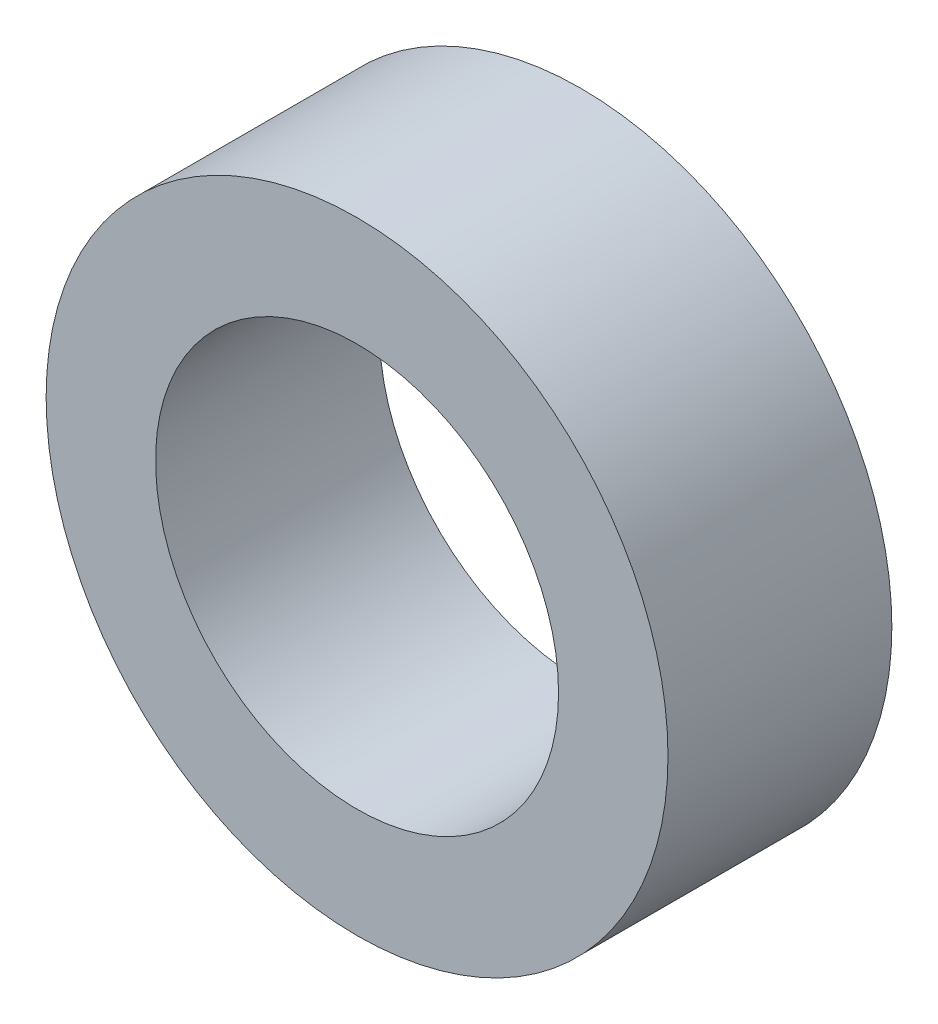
ISO-10303-21;
HEADER;
FILE_DESCRIPTION(('STEP AP214'),'2;1');
FILE_NAME('part.step','',(''),(''),'','','');
FILE_SCHEMA(('AUTOMOTIVE_DESIGN { 1 0 10303 214 1 1 1 1 }'));
ENDSEC;
DATA;
#1=APPLICATION_CONTEXT('core data for automotive mechanical design processes');
#2=APPLICATION_PROTOCOL_DEFINITION('international standard','automotive_design',2000,#1);
#3=PRODUCT_CONTEXT('',#1,'mechanical');
#4=PRODUCT('Part','Part','',(#3));
#5=PRODUCT_RELATED_PRODUCT_CATEGORY('part','',(#4));
#6=PRODUCT_DEFINITION_FORMATION('','',#4);
#7=PRODUCT_DEFINITION_CONTEXT('part definition',#1,'design');
#8=PRODUCT_DEFINITION('design','',#6,#7);
#9=PRODUCT_DEFINITION_SHAPE('','',#8);
#10=(LENGTH_UNIT() NAMED_UNIT(*) SI_UNIT(.MILLI.,.METRE.));
#11=(NAMED_UNIT(*) PLANE_ANGLE_UNIT() SI_UNIT($,.RADIAN.));
#12=(NAMED_UNIT(*) SI_UNIT($,.STERADIAN.) SOLID_ANGLE_UNIT());
#13=UNCERTAINTY_MEASURE_WITH_UNIT(LENGTH_MEASURE(1.E-05),#10,'distance_accuracy_value','');
#14=(GEOMETRIC_REPRESENTATION_CONTEXT(3) GLOBAL_UNCERTAINTY_ASSIGNED_CONTEXT((#13)) GLOBAL_UNIT_ASSIGNED_CONTEXT((#10,
#11,#12)) REPRESENTATION_CONTEXT('',''));
#15=CARTESIAN_POINT('',(0.,0.,0.));
#16=DIRECTION('',(0.,0.,1.));
#17=DIRECTION('',(1.,0.,0.));
#18=AXIS2_PLACEMENT_3D('',#15,#16,#17);
#19=CARTESIAN_POINT('',(0.,0.,9.));
#20=DIRECTION('',(0.,0.,1.));
#21=DIRECTION('',(1.,0.,0.));
#22=AXIS2_PLACEMENT_3D('',#19,#20,#21);
#23=PLANE('',#22);
#24=CARTESIAN_POINT('',(0.,0.,9.));
#25=DIRECTION('',(0.,0.,1.));
#26=DIRECTION('',(1.,0.,0.));
#27=AXIS2_PLACEMENT_3D('',#24,#25,#26);
#28=CIRCLE('',#27,12.5);
#29=CARTESIAN_POINT('',(12.5,0.,9.));
#30=VERTEX_POINT('',#29);
#31=EDGE_CURVE('E10',#30,#30,#28,.T.);
#32=ORIENTED_EDGE('',*,*,#31,.T.);
#33=EDGE_LOOP('',(#32));
#34=FACE_BOUND('',#33,.T.);
#35=CARTESIAN_POINT('',(0.,0.,9.));
#36=DIRECTION('',(0.,0.,1.));
#37=DIRECTION('',(1.,0.,0.));
#38=AXIS2_PLACEMENT_3D('',#35,#36,#37);
#39=CIRCLE('',#38,8.1);
#40=CARTESIAN_POINT('',(8.1,0.,9.));
#41=VERTEX_POINT('',#40);
#42=EDGE_CURVE('E49',#41,#41,#39,.T.);
#43=ORIENTED_EDGE('',*,*,#42,.F.);
#44=EDGE_LOOP('',(#43));
#45=FACE_BOUND('',#44,.T.);
#46=ADVANCED_FACE('F34',(#34,#45),#23,.T.);
#47=CARTESIAN_POINT('',(0.,0.,0.));
#48=DIRECTION('',(0.,0.,1.));
#49=DIRECTION('',(1.,0.,0.));
#50=AXIS2_PLACEMENT_3D('',#47,#48,#49);
#51=PLANE('',#50);
#52=CARTESIAN_POINT('',(0.,0.,0.));
#53=DIRECTION('',(0.,0.,1.));
#54=DIRECTION('',(1.,0.,0.));
#55=AXIS2_PLACEMENT_3D('',#52,#53,#54);
#56=CIRCLE('',#55,12.5);
#57=CARTESIAN_POINT('',(12.5,0.,0.));
#58=VERTEX_POINT('',#57);
#59=EDGE_CURVE('E42',#58,#58,#56,.T.);
#60=ORIENTED_EDGE('',*,*,#59,.F.);
#61=EDGE_LOOP('',(#60));
#62=FACE_BOUND('',#61,.T.);
#63=CARTESIAN_POINT('',(0.,0.,0.));
#64=DIRECTION('',(0.,0.,1.));
#65=DIRECTION('',(1.,0.,0.));
#66=AXIS2_PLACEMENT_3D('',#63,#64,#65);
#67=CIRCLE('',#66,8.1);
#68=CARTESIAN_POINT('',(8.1,0.,0.));
#69=VERTEX_POINT('',#68);
#70=EDGE_CURVE('E53',#69,#69,#67,.T.);
#71=ORIENTED_EDGE('',*,*,#70,.T.);
#72=EDGE_LOOP('',(#71));
#73=FACE_BOUND('',#72,.T.);
#74=ADVANCED_FACE('F59',(#62,#73),#51,.F.);
#75=CARTESIAN_POINT('',(0.,0.,9.));
#76=DIRECTION('',(0.,0.,-1.));
#77=DIRECTION('',(-1.,0.,0.));
#78=AXIS2_PLACEMENT_3D('',#75,#76,#77);
#79=CYLINDRICAL_SURFACE('',#78,12.5);
#80=ORIENTED_EDGE('',*,*,#31,.F.);
#81=EDGE_LOOP('',(#80));
#82=FACE_BOUND('',#81,.T.);
#83=ORIENTED_EDGE('',*,*,#59,.T.);
#84=EDGE_LOOP('',(#83));
#85=FACE_BOUND('',#84,.T.);
#86=ADVANCED_FACE('F36',(#82,#85),#79,.T.);
#87=CARTESIAN_POINT('',(0.,0.,9.));
#88=DIRECTION('',(0.,0.,-1.));
#89=DIRECTION('',(-1.,0.,0.));
#90=AXIS2_PLACEMENT_3D('',#87,#88,#89);
#91=CYLINDRICAL_SURFACE('',#90,8.1);
#92=ORIENTED_EDGE('',*,*,#42,.T.);
#93=EDGE_LOOP('',(#92));
#94=FACE_BOUND('',#93,.T.);
#95=ORIENTED_EDGE('',*,*,#70,.F.);
#96=EDGE_LOOP('',(#95));
#97=FACE_BOUND('',#96,.T.);
#98=ADVANCED_FACE('F61',(#94,#97),#91,.F.);
#99=CLOSED_SHELL('',(#46,#74,#86,#98));
#100=MANIFOLD_SOLID_BREP('B2',#99);
#101=ADVANCED_BREP_SHAPE_REPRESENTATION('',(#18,#100),#14);
#102=SHAPE_DEFINITION_REPRESENTATION(#9,#101);
ENDSEC;
END-ISO-10303-21;
